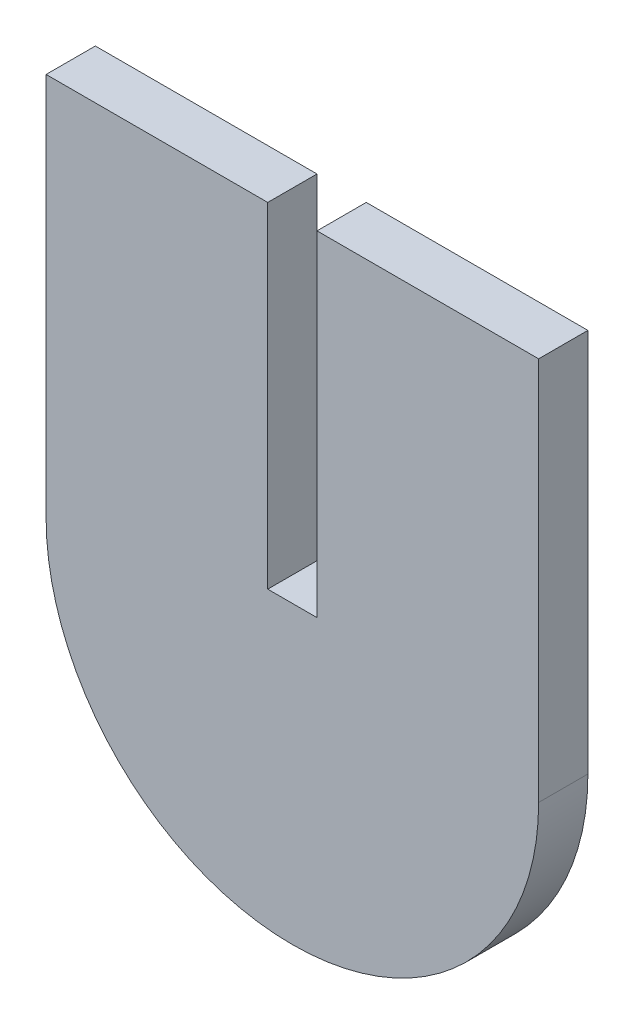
ISO-10303-21;
HEADER;
FILE_DESCRIPTION(('STEP AP214'),'2;1');
FILE_NAME('part.step','',(''),(''),'','','');
FILE_SCHEMA(('AUTOMOTIVE_DESIGN { 1 0 10303 214 1 1 1 1 }'));
ENDSEC;
DATA;
#1=APPLICATION_CONTEXT('core data for automotive mechanical design processes');
#2=APPLICATION_PROTOCOL_DEFINITION('international standard','automotive_design',2000,#1);
#3=PRODUCT_CONTEXT('',#1,'mechanical');
#4=PRODUCT('Part','Part','',(#3));
#5=PRODUCT_RELATED_PRODUCT_CATEGORY('part','',(#4));
#6=PRODUCT_DEFINITION_FORMATION('','',#4);
#7=PRODUCT_DEFINITION_CONTEXT('part definition',#1,'design');
#8=PRODUCT_DEFINITION('design','',#6,#7);
#9=PRODUCT_DEFINITION_SHAPE('','',#8);
#10=(LENGTH_UNIT() NAMED_UNIT(*) SI_UNIT(.MILLI.,.METRE.));
#11=(NAMED_UNIT(*) PLANE_ANGLE_UNIT() SI_UNIT($,.RADIAN.));
#12=(NAMED_UNIT(*) SI_UNIT($,.STERADIAN.) SOLID_ANGLE_UNIT());
#13=UNCERTAINTY_MEASURE_WITH_UNIT(LENGTH_MEASURE(1.E-05),#10,'distance_accuracy_value','');
#14=(GEOMETRIC_REPRESENTATION_CONTEXT(3) GLOBAL_UNCERTAINTY_ASSIGNED_CONTEXT((#13)) GLOBAL_UNIT_ASSIGNED_CONTEXT((#10,
#11,#12)) REPRESENTATION_CONTEXT('',''));
#15=CARTESIAN_POINT('',(0.,0.,0.));
#16=DIRECTION('',(0.,0.,1.));
#17=DIRECTION('',(1.,0.,0.));
#18=AXIS2_PLACEMENT_3D('',#15,#16,#17);
#19=CARTESIAN_POINT('',(-15.875,10.795,0.));
#20=DIRECTION('',(0.,-1.,0.));
#21=DIRECTION('',(0.,0.,-1.));
#22=AXIS2_PLACEMENT_3D('',#19,#20,#21);
#23=PLANE('',#22);
#24=DIRECTION('',(1.,0.,0.));
#25=VECTOR('',#24,1.);
#26=CARTESIAN_POINT('',(-15.875,10.795,3.175));
#27=LINE('',#26,#25);
#28=CARTESIAN_POINT('',(-15.875,10.795,3.175));
#29=VERTEX_POINT('',#28);
#30=CARTESIAN_POINT('',(-1.5875,10.795,3.175));
#31=VERTEX_POINT('',#30);
#32=EDGE_CURVE('E98',#29,#31,#27,.T.);
#33=ORIENTED_EDGE('',*,*,#32,.T.);
#34=DIRECTION('',(0.,0.,1.));
#35=VECTOR('',#34,1.);
#36=CARTESIAN_POINT('',(-1.5875,10.795,0.));
#37=LINE('',#36,#35);
#38=CARTESIAN_POINT('',(-1.5875,10.795,0.));
#39=VERTEX_POINT('',#38);
#40=EDGE_CURVE('E107',#39,#31,#37,.T.);
#41=ORIENTED_EDGE('',*,*,#40,.F.);
#42=DIRECTION('',(1.,0.,0.));
#43=VECTOR('',#42,1.);
#44=CARTESIAN_POINT('',(-15.875,10.795,0.));
#45=LINE('',#44,#43);
#46=CARTESIAN_POINT('',(-15.875,10.795,0.));
#47=VERTEX_POINT('',#46);
#48=EDGE_CURVE('E90',#47,#39,#45,.T.);
#49=ORIENTED_EDGE('',*,*,#48,.F.);
#50=DIRECTION('',(0.,0.,1.));
#51=VECTOR('',#50,1.);
#52=CARTESIAN_POINT('',(-15.875,10.795,0.));
#53=LINE('',#52,#51);
#54=EDGE_CURVE('E74',#47,#29,#53,.T.);
#55=ORIENTED_EDGE('',*,*,#54,.T.);
#56=EDGE_LOOP('',(#33,#41,#49,#55));
#57=FACE_BOUND('',#56,.T.);
#58=ADVANCED_FACE('F31',(#57),#23,.F.);
#59=CARTESIAN_POINT('',(0.,-13.97,3.175));
#60=DIRECTION('',(0.,0.,-1.));
#61=DIRECTION('',(-1.,0.,0.));
#62=AXIS2_PLACEMENT_3D('',#59,#60,#61);
#63=CYLINDRICAL_SURFACE('',#62,15.875);
#64=CARTESIAN_POINT('',(0.,-13.97,0.));
#65=DIRECTION('',(0.,0.,1.));
#66=DIRECTION('',(1.,0.,0.));
#67=AXIS2_PLACEMENT_3D('',#64,#65,#66);
#68=CIRCLE('',#67,15.875);
#69=CARTESIAN_POINT('',(-15.875,-13.97,0.));
#70=VERTEX_POINT('',#69);
#71=CARTESIAN_POINT('',(15.875,-13.97,0.));
#72=VERTEX_POINT('',#71);
#73=EDGE_CURVE('E84',#70,#72,#68,.T.);
#74=ORIENTED_EDGE('',*,*,#73,.T.);
#75=DIRECTION('',(0.,0.,-1.));
#76=VECTOR('',#75,1.);
#77=CARTESIAN_POINT('',(15.875,-13.97,3.175));
#78=LINE('',#77,#76);
#79=CARTESIAN_POINT('',(15.875,-13.97,3.175));
#80=VERTEX_POINT('',#79);
#81=EDGE_CURVE('E11',#80,#72,#78,.T.);
#82=ORIENTED_EDGE('',*,*,#81,.F.);
#83=CARTESIAN_POINT('',(0.,-13.97,3.175));
#84=DIRECTION('',(0.,0.,1.));
#85=DIRECTION('',(1.,0.,0.));
#86=AXIS2_PLACEMENT_3D('',#83,#84,#85);
#87=CIRCLE('',#86,15.875);
#88=CARTESIAN_POINT('',(-15.875,-13.97,3.175));
#89=VERTEX_POINT('',#88);
#90=EDGE_CURVE('E78',#89,#80,#87,.T.);
#91=ORIENTED_EDGE('',*,*,#90,.F.);
#92=DIRECTION('',(0.,0.,-1.));
#93=VECTOR('',#92,1.);
#94=CARTESIAN_POINT('',(-15.875,-13.97,3.175));
#95=LINE('',#94,#93);
#96=EDGE_CURVE('E39',#89,#70,#95,.T.);
#97=ORIENTED_EDGE('',*,*,#96,.T.);
#98=EDGE_LOOP('',(#74,#82,#91,#97));
#99=FACE_BOUND('',#98,.T.);
#100=ADVANCED_FACE('F33',(#99),#63,.T.);
#101=CARTESIAN_POINT('',(15.875,13.97,3.175));
#102=DIRECTION('',(-1.,0.,0.));
#103=DIRECTION('',(0.,0.,1.));
#104=AXIS2_PLACEMENT_3D('',#101,#102,#103);
#105=PLANE('',#104);
#106=DIRECTION('',(0.,1.,0.));
#107=VECTOR('',#106,1.);
#108=CARTESIAN_POINT('',(15.875,13.97,0.));
#109=LINE('',#108,#107);
#110=CARTESIAN_POINT('',(15.875,10.795,0.));
#111=VERTEX_POINT('',#110);
#112=EDGE_CURVE('E79',#72,#111,#109,.T.);
#113=ORIENTED_EDGE('',*,*,#112,.T.);
#114=DIRECTION('',(0.,0.,1.));
#115=VECTOR('',#114,1.);
#116=CARTESIAN_POINT('',(15.875,10.795,0.));
#117=LINE('',#116,#115);
#118=CARTESIAN_POINT('',(15.875,10.795,3.175));
#119=VERTEX_POINT('',#118);
#120=EDGE_CURVE('E104',#111,#119,#117,.T.);
#121=ORIENTED_EDGE('',*,*,#120,.T.);
#122=DIRECTION('',(0.,1.,0.));
#123=VECTOR('',#122,1.);
#124=CARTESIAN_POINT('',(15.875,13.97,3.175));
#125=LINE('',#124,#123);
#126=EDGE_CURVE('E94',#80,#119,#125,.T.);
#127=ORIENTED_EDGE('',*,*,#126,.F.);
#128=ORIENTED_EDGE('',*,*,#81,.T.);
#129=EDGE_LOOP('',(#113,#121,#127,#128));
#130=FACE_BOUND('',#129,.T.);
#131=ADVANCED_FACE('F175',(#130),#105,.F.);
#132=CARTESIAN_POINT('',(-15.875,13.97,3.175));
#133=DIRECTION('',(1.,0.,0.));
#134=DIRECTION('',(0.,1.,0.));
#135=AXIS2_PLACEMENT_3D('',#132,#133,#134);
#136=PLANE('',#135);
#137=DIRECTION('',(0.,-1.,0.));
#138=VECTOR('',#137,1.);
#139=CARTESIAN_POINT('',(-15.875,13.97,3.175));
#140=LINE('',#139,#138);
#141=EDGE_CURVE('E55',#29,#89,#140,.T.);
#142=ORIENTED_EDGE('',*,*,#141,.F.);
#143=ORIENTED_EDGE('',*,*,#54,.F.);
#144=DIRECTION('',(0.,-1.,0.));
#145=VECTOR('',#144,1.);
#146=CARTESIAN_POINT('',(-15.875,13.97,0.));
#147=LINE('',#146,#145);
#148=EDGE_CURVE('E69',#47,#70,#147,.T.);
#149=ORIENTED_EDGE('',*,*,#148,.T.);
#150=ORIENTED_EDGE('',*,*,#96,.F.);
#151=EDGE_LOOP('',(#142,#143,#149,#150));
#152=FACE_BOUND('',#151,.T.);
#153=ADVANCED_FACE('F71',(#152),#136,.F.);
#154=CARTESIAN_POINT('',(0.,-13.97,3.175));
#155=DIRECTION('',(0.,0.,1.));
#156=DIRECTION('',(1.,0.,0.));
#157=AXIS2_PLACEMENT_3D('',#154,#155,#156);
#158=PLANE('',#157);
#159=DIRECTION('',(0.,-1.,0.));
#160=VECTOR('',#159,1.);
#161=CARTESIAN_POINT('',(-1.5875,10.795,3.175));
#162=LINE('',#161,#160);
#163=CARTESIAN_POINT('',(-1.5875,-10.795,3.175));
#164=VERTEX_POINT('',#163);
#165=EDGE_CURVE('E123',#31,#164,#162,.T.);
#166=ORIENTED_EDGE('',*,*,#165,.F.);
#167=ORIENTED_EDGE('',*,*,#32,.F.);
#168=ORIENTED_EDGE('',*,*,#141,.T.);
#169=ORIENTED_EDGE('',*,*,#90,.T.);
#170=ORIENTED_EDGE('',*,*,#126,.T.);
#171=CARTESIAN_POINT('',(1.5875,10.795,3.175));
#172=VERTEX_POINT('',#171);
#173=EDGE_CURVE('E102',#172,#119,#27,.T.);
#174=ORIENTED_EDGE('',*,*,#173,.F.);
#175=DIRECTION('',(0.,1.,0.));
#176=VECTOR('',#175,1.);
#177=CARTESIAN_POINT('',(1.5875,10.795,3.175));
#178=LINE('',#177,#176);
#179=CARTESIAN_POINT('',(1.5875,-10.795,3.175));
#180=VERTEX_POINT('',#179);
#181=EDGE_CURVE('E46',#180,#172,#178,.T.);
#182=ORIENTED_EDGE('',*,*,#181,.F.);
#183=DIRECTION('',(1.,0.,0.));
#184=VECTOR('',#183,1.);
#185=CARTESIAN_POINT('',(1.5875,-10.795,3.175));
#186=LINE('',#185,#184);
#187=EDGE_CURVE('E120',#164,#180,#186,.T.);
#188=ORIENTED_EDGE('',*,*,#187,.F.);
#189=EDGE_LOOP('',(#166,#167,#168,#169,#170,#174,#182,#188));
#190=FACE_BOUND('',#189,.T.);
#191=ADVANCED_FACE('F152',(#190),#158,.T.);
#192=CARTESIAN_POINT('',(0.,-13.97,0.));
#193=DIRECTION('',(0.,0.,1.));
#194=DIRECTION('',(1.,0.,0.));
#195=AXIS2_PLACEMENT_3D('',#192,#193,#194);
#196=PLANE('',#195);
#197=ORIENTED_EDGE('',*,*,#48,.T.);
#198=DIRECTION('',(0.,-1.,0.));
#199=VECTOR('',#198,1.);
#200=CARTESIAN_POINT('',(-1.5875,10.795,0.));
#201=LINE('',#200,#199);
#202=CARTESIAN_POINT('',(-1.5875,-10.795,0.));
#203=VERTEX_POINT('',#202);
#204=EDGE_CURVE('E119',#39,#203,#201,.T.);
#205=ORIENTED_EDGE('',*,*,#204,.T.);
#206=DIRECTION('',(1.,0.,0.));
#207=VECTOR('',#206,1.);
#208=CARTESIAN_POINT('',(1.5875,-10.795,0.));
#209=LINE('',#208,#207);
#210=CARTESIAN_POINT('',(1.5875,-10.795,0.));
#211=VERTEX_POINT('',#210);
#212=EDGE_CURVE('E128',#203,#211,#209,.T.);
#213=ORIENTED_EDGE('',*,*,#212,.T.);
#214=DIRECTION('',(0.,1.,0.));
#215=VECTOR('',#214,1.);
#216=CARTESIAN_POINT('',(1.5875,10.795,0.));
#217=LINE('',#216,#215);
#218=CARTESIAN_POINT('',(1.5875,10.795,0.));
#219=VERTEX_POINT('',#218);
#220=EDGE_CURVE('E112',#211,#219,#217,.T.);
#221=ORIENTED_EDGE('',*,*,#220,.T.);
#222=EDGE_CURVE('E101',#219,#111,#45,.T.);
#223=ORIENTED_EDGE('',*,*,#222,.T.);
#224=ORIENTED_EDGE('',*,*,#112,.F.);
#225=ORIENTED_EDGE('',*,*,#73,.F.);
#226=ORIENTED_EDGE('',*,*,#148,.F.);
#227=EDGE_LOOP('',(#197,#205,#213,#221,#223,#224,#225,#226));
#228=FACE_BOUND('',#227,.T.);
#229=ADVANCED_FACE('F85',(#228),#196,.F.);
#230=ORIENTED_EDGE('',*,*,#222,.F.);
#231=DIRECTION('',(0.,0.,1.));
#232=VECTOR('',#231,1.);
#233=CARTESIAN_POINT('',(1.5875,10.795,0.));
#234=LINE('',#233,#232);
#235=EDGE_CURVE('E114',#219,#172,#234,.T.);
#236=ORIENTED_EDGE('',*,*,#235,.T.);
#237=ORIENTED_EDGE('',*,*,#173,.T.);
#238=ORIENTED_EDGE('',*,*,#120,.F.);
#239=EDGE_LOOP('',(#230,#236,#237,#238));
#240=FACE_BOUND('',#239,.T.);
#241=ADVANCED_FACE('F172',(#240),#23,.F.);
#242=CARTESIAN_POINT('',(-1.5875,10.795,0.));
#243=DIRECTION('',(-1.,0.,0.));
#244=DIRECTION('',(0.,-1.,0.));
#245=AXIS2_PLACEMENT_3D('',#242,#243,#244);
#246=PLANE('',#245);
#247=ORIENTED_EDGE('',*,*,#165,.T.);
#248=DIRECTION('',(0.,0.,1.));
#249=VECTOR('',#248,1.);
#250=CARTESIAN_POINT('',(-1.5875,-10.795,0.));
#251=LINE('',#250,#249);
#252=EDGE_CURVE('E108',#203,#164,#251,.T.);
#253=ORIENTED_EDGE('',*,*,#252,.F.);
#254=ORIENTED_EDGE('',*,*,#204,.F.);
#255=ORIENTED_EDGE('',*,*,#40,.T.);
#256=EDGE_LOOP('',(#247,#253,#254,#255));
#257=FACE_BOUND('',#256,.T.);
#258=ADVANCED_FACE('F143',(#257),#246,.F.);
#259=CARTESIAN_POINT('',(1.5875,10.795,0.));
#260=DIRECTION('',(1.,0.,0.));
#261=DIRECTION('',(0.,1.,0.));
#262=AXIS2_PLACEMENT_3D('',#259,#260,#261);
#263=PLANE('',#262);
#264=ORIENTED_EDGE('',*,*,#181,.T.);
#265=ORIENTED_EDGE('',*,*,#235,.F.);
#266=ORIENTED_EDGE('',*,*,#220,.F.);
#267=DIRECTION('',(0.,0.,1.));
#268=VECTOR('',#267,1.);
#269=CARTESIAN_POINT('',(1.5875,-10.795,0.));
#270=LINE('',#269,#268);
#271=EDGE_CURVE('E111',#211,#180,#270,.T.);
#272=ORIENTED_EDGE('',*,*,#271,.T.);
#273=EDGE_LOOP('',(#264,#265,#266,#272));
#274=FACE_BOUND('',#273,.T.);
#275=ADVANCED_FACE('F168',(#274),#263,.F.);
#276=CARTESIAN_POINT('',(1.5875,-10.795,0.));
#277=DIRECTION('',(0.,-1.,0.));
#278=DIRECTION('',(0.,0.,-1.));
#279=AXIS2_PLACEMENT_3D('',#276,#277,#278);
#280=PLANE('',#279);
#281=ORIENTED_EDGE('',*,*,#187,.T.);
#282=ORIENTED_EDGE('',*,*,#271,.F.);
#283=ORIENTED_EDGE('',*,*,#212,.F.);
#284=ORIENTED_EDGE('',*,*,#252,.T.);
#285=EDGE_LOOP('',(#281,#282,#283,#284));
#286=FACE_BOUND('',#285,.T.);
#287=ADVANCED_FACE('F167',(#286),#280,.F.);
#288=CLOSED_SHELL('',(#58,#100,#131,#153,#191,#229,#241,#258,#275,#287));
#289=MANIFOLD_SOLID_BREP('B2',#288);
#290=ADVANCED_BREP_SHAPE_REPRESENTATION('',(#18,#289),#14);
#291=SHAPE_DEFINITION_REPRESENTATION(#9,#290);
ENDSEC;
END-ISO-10303-21;
